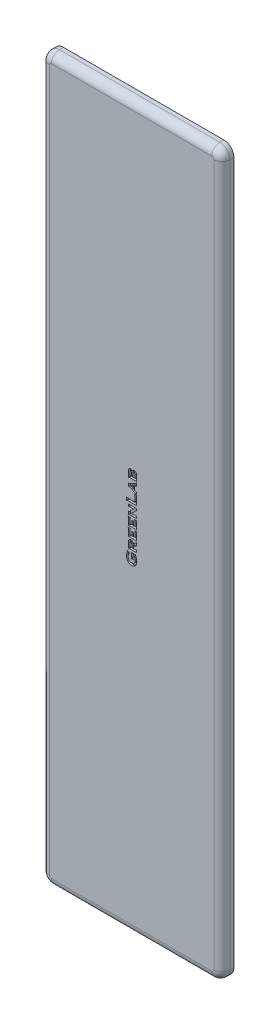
from build123d import *

# Parameters (mm, degrees)
BOSS_EXTRUDE1_DEPTH = 3
FILLET1_R           = 2.5
FILLET2_R           = 2
CUT_EXTRUDE1_DEPTH  = 0.5


with BuildPart() as part:
    # Sketch1 → Boss-Extrude1 (new body)
    with BuildSketch(Plane.XY.offset(3)):
        Polygon((-22.500000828, -67.499998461), (22.499998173, -67.499998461), (22.499998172, 112.500001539), (-22.500000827, 112.500001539), align=None)
    extrude(amount=-BOSS_EXTRUDE1_DEPTH)

    # Fillet1
    fillet1_edges = [part.edges().sort_by_distance(p)[0] for p in [
        (-22.500000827, 112.500001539, 1.5),
        (22.499998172, 112.500001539, 1.5),
        (22.499998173, -67.499998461, 1.5),
        (-22.500000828, -67.499998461, 1.5),
    ]]
    fillet(fillet1_edges, radius=FILLET1_R)

    # Fillet2
    fillet2_edges = [part.edges().sort_by_distance(p)[0] for p in [
        (-1.328e-06, -67.499998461, 3),
        (-22.500000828, 22.500001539, 3),
        (22.499998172, 22.500001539, 3),
        (-1.328e-06, 112.500001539, 3),
        (-21.76776778, 111.767768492, 3),
        (21.767765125, 111.767768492, 3),
        (-21.76776778, -66.767765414, 3),
        (21.767765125, -66.767765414, 3),
    ]]
    fillet(fillet2_edges, radius=FILLET2_R)

    # Sketch2 → Cut-Extrude1 (cut)
    # profile 1 of 8: a face of its own
    with BuildSketch(Plane.XY.offset(3)):
        with BuildLine():
            add(Edge.make_bspline(
                [(0.149737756, 32.573786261), (0.160987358, 32.59764489), (0.182190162, 32.64261269), (0.216982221, 32.703529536), (0.251274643, 32.754864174), (0.276750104, 32.783444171), (0.288626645, 32.796768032)],
                knots=[0, 0, 0, 0, 1.199284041, 2.260363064, 3.188989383, 4, 4, 4, 4], degree=3))
            add(Edge.make_bspline(
                [(0.288626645, 32.796768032), (0.29979615, 32.807686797), (0.322146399, 32.829535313), (0.359591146, 32.85773896), (0.40028128, 32.880998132), (0.443105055, 32.90093009), (0.489353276, 32.915333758), (0.538137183, 32.926237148), (0.58991576, 32.932845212), (0.625340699, 32.933628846), (0.643444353, 32.934029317)],
                knots=[0, 0, 0, 0, 0.957204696, 1.915372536, 2.864513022, 3.827290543, 4.805779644, 5.828215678, 6.89012558, 8, 8, 8, 8], degree=3))
            add(Edge.make_bspline(
                [(0.643444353, 32.934029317), (0.667718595, 32.933487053), (0.715052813, 32.93242965), (0.783999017, 32.921764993), (0.848793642, 32.904777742), (0.9090388, 32.879795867), (0.96540742, 32.849149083), (1.016788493, 32.810327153), (1.064588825, 32.765338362), (1.091833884, 32.730423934), (1.105683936, 32.71267515)],
                knots=[0, 0, 0, 0, 1.09149512, 2.128390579, 3.131133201, 4.098244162, 5.056171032, 6.009871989, 6.988316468, 8, 8, 8, 8], degree=3))
            add(Edge.make_bspline(
                [(1.105683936, 32.71267515), (1.117267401, 32.695720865), (1.140816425, 32.661253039), (1.169712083, 32.60441657), (1.194738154, 32.543453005), (1.215470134, 32.477999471), (1.231169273, 32.407741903), (1.241448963, 32.332768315), (1.249055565, 32.253302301), (1.24967814, 32.198733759), (1.249998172, 32.170682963)],
                knots=[0, 0, 0, 0, 0.863603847, 1.755694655, 2.67743618, 3.635676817, 4.642232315, 5.703768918, 6.81962927, 8, 8, 8, 8], degree=3))
            Line((1.249998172, 32.170682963), (1.249998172, 30.746529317))
            Line((1.249998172, 30.746529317), (1.180553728, 30.746529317))
            add(Edge.make_bspline(
                [(1.180553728, 30.746529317), (1.177623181, 30.755433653), (1.172139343, 30.772096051), (1.162203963, 30.795123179), (1.148957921, 30.812951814), (1.134356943, 30.827491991), (1.116807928, 30.837942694), (1.096627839, 30.845532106), (1.073123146, 30.849790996), (1.056511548, 30.850380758), (1.047632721, 30.850695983)],
                knots=[0, 0, 0, 0, 1.214308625, 2.272296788, 3.227641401, 4.072125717, 4.923398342, 5.849609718, 6.850625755, 8, 8, 8, 8], degree=3))
            Line((1.047632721, 30.850695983), (-0.596247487, 30.850695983))
            add(Edge.make_bspline(
                [(-0.596247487, 30.850695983), (-0.604926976, 30.850288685), (-0.621290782, 30.849520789), (-0.644641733, 30.846369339), (-0.66416822, 30.838320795), (-0.681549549, 30.828657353), (-0.695396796, 30.813814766), (-0.708697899, 30.795901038), (-0.719743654, 30.772714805), (-0.725893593, 30.755628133), (-0.729168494, 30.746529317)],
                knots=[0, 0, 0, 0, 1.128659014, 2.127908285, 3.03439063, 3.855433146, 4.685150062, 5.642745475, 6.744739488, 8, 8, 8, 8], degree=3))
            Line((-0.729168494, 30.746529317), (-0.798612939, 30.746529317))
            Line((-0.798612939, 30.746529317), (-0.798612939, 32.144098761))
            add(Edge.make_bspline(
                [(-0.798612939, 32.144098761), (-0.798251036, 32.173773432), (-0.797552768, 32.231028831), (-0.79068897, 32.313759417), (-0.781014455, 32.390569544), (-0.765612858, 32.461011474), (-0.746968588, 32.525634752), (-0.723378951, 32.583770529), (-0.69682557, 32.636855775), (-0.674090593, 32.667741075), (-0.662979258, 32.68283574)],
                knots=[0, 0, 0, 0, 1.259629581, 2.430375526, 3.522812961, 4.543893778, 5.488959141, 6.374407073, 7.205519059, 8, 8, 8, 8], degree=3))
            add(Edge.make_bspline(
                [(-0.662979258, 32.68283574), (-0.650841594, 32.697438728), (-0.626988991, 32.726136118), (-0.585832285, 32.763198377), (-0.54149608, 32.794408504), (-0.493943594, 32.820011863), (-0.44307772, 32.840469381), (-0.388656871, 32.854100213), (-0.331080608, 32.863326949), (-0.291562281, 32.864158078), (-0.271269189, 32.864584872)],
                knots=[0, 0, 0, 0, 1.01613969, 1.996889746, 2.956405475, 3.914354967, 4.883989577, 5.884961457, 6.913904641, 8, 8, 8, 8], degree=3))
            add(Edge.make_bspline(
                [(-0.271269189, 32.864584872), (-0.247871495, 32.86402936), (-0.202878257, 32.862961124), (-0.138993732, 32.850035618), (-0.081312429, 32.830304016), (-0.029702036, 32.800474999), (0.017372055, 32.759996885), (0.064071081, 32.70980497), (0.107836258, 32.645932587), (0.135237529, 32.598752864), (0.149737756, 32.573786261)],
                knots=[0, 0, 0, 0, 1.030716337, 1.982044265, 2.862735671, 3.709827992, 4.593441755, 5.592771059, 6.726140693, 8, 8, 8, 8], degree=3))
        make_face()
        with BuildLine():
            Line((-0.03472405, 31.336807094), (-0.03472405, 32.063803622))
            add(Edge.make_bspline(
                [(-0.03472405, 32.063803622), (-0.035159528, 32.090411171), (-0.035964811, 32.139613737), (-0.04370633, 32.207132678), (-0.056634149, 32.262343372), (-0.075539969, 32.30623832), (-0.102007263, 32.339792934), (-0.136975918, 32.362782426), (-0.179493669, 32.376567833), (-0.21039312, 32.377813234), (-0.226781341, 32.378473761)],
                knots=[0, 0, 0, 0, 1.512131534, 2.796227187, 3.855933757, 4.725485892, 5.492963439, 6.248574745, 7.071092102, 8, 8, 8, 8], degree=3))
            add(Edge.make_bspline(
                [(-0.226781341, 32.378473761), (-0.242979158, 32.377782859), (-0.273278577, 32.376490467), (-0.31534993, 32.363206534), (-0.349724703, 32.340325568), (-0.376544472, 32.307291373), (-0.395387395, 32.26346797), (-0.407525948, 32.207956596), (-0.415483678, 32.140166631), (-0.416252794, 32.090596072), (-0.416668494, 32.063803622)],
                knots=[0, 0, 0, 0, 0.921305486, 1.723381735, 2.481162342, 3.2428606, 4.114909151, 5.17520465, 6.473222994, 8, 8, 8, 8], degree=3))
            Line((-0.416668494, 32.063803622), (-0.416668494, 31.336807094))
            Line((-0.416668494, 31.336807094), (-0.03472405, 31.336807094))
        make_face(mode=Mode.SUBTRACT)
        with BuildLine():
            Line((0.868053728, 31.336807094), (0.868053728, 32.085505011))
            add(Edge.make_bspline(
                [(0.868053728, 32.085505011), (0.867565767, 32.113963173), (0.866652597, 32.167219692), (0.853833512, 32.241380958), (0.834710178, 32.30502837), (0.805586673, 32.357174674), (0.76845028, 32.398833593), (0.721741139, 32.427278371), (0.667380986, 32.445660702), (0.628235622, 32.447139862), (0.607637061, 32.447918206)],
                knots=[0, 0, 0, 0, 1.344028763, 2.515211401, 3.548364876, 4.471249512, 5.318650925, 6.156286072, 7.02982502, 8, 8, 8, 8], degree=3))
            add(Edge.make_bspline(
                [(0.607637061, 32.447918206), (0.587240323, 32.447082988), (0.548143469, 32.445482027), (0.493705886, 32.427599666), (0.44736724, 32.39843613), (0.409494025, 32.357570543), (0.381460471, 32.304701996), (0.360996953, 32.241603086), (0.349582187, 32.167106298), (0.348043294, 32.113936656), (0.347220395, 32.085505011)],
                knots=[0, 0, 0, 0, 0.962178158, 1.844321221, 2.675172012, 3.52884247, 4.448055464, 5.484422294, 6.65483368, 8, 8, 8, 8], degree=3))
            Line((0.347220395, 32.085505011), (0.347220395, 31.336807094))
            Line((0.347220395, 31.336807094), (0.868053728, 31.336807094))
        make_face(mode=Mode.SUBTRACT)
    # profile 2 of 8: a face of its own
    with BuildSketch(Plane.XY.offset(3)):
        with BuildLine():
            Line((0.729164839, 29.639758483), (0.729164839, 28.689780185))
            Line((0.729164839, 28.689780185), (0.947806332, 28.576390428))
            add(Edge.make_bspline(
                [(0.947806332, 28.576390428), (0.960192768, 28.570549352), (0.983197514, 28.559700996), (1.016500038, 28.547998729), (1.045198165, 28.539239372), (1.063317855, 28.538296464), (1.071504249, 28.537870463)],
                knots=[0, 0, 0, 0, 1.258188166, 2.336773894, 3.248561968, 4, 4, 4, 4], degree=3))
            add(Edge.make_bspline(
                [(1.071504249, 28.537870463), (1.078406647, 28.538352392), (1.091711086, 28.539281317), (1.110837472, 28.54462105), (1.127713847, 28.554902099), (1.14210413, 28.569396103), (1.155730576, 28.586872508), (1.165503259, 28.609204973), (1.174322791, 28.634771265), (1.178400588, 28.653373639), (1.180553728, 28.663195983)],
                knots=[0, 0, 0, 0, 0.910861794, 1.755694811, 2.589696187, 3.483236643, 4.43677035, 5.49240796, 6.675952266, 8, 8, 8, 8], degree=3))
            Line((1.180553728, 28.663195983), (1.249998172, 28.663195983))
            Line((1.249998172, 28.663195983), (1.249998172, 27.934029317))
            Line((1.249998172, 27.934029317), (1.180553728, 27.934029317))
            add(Edge.make_bspline(
                [(1.180553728, 27.934029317), (1.178632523, 27.944935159), (1.174963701, 27.965761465), (1.165953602, 27.994266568), (1.154370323, 28.0184747), (1.139570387, 28.039331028), (1.118917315, 28.057801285), (1.092651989, 28.077588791), (1.05821652, 28.097628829), (1.032671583, 28.111176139), (1.018878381, 28.118491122)],
                knots=[0, 0, 0, 0, 1.025916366, 1.959137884, 2.761484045, 3.50604026, 4.312579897, 5.318573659, 6.552141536, 8, 8, 8, 8], degree=3))
            Line((1.018878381, 28.118491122), (-0.467124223, 28.872614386))
            add(Edge.make_bspline(
                [(-0.467124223, 28.872614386), (-0.480594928, 28.878971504), (-0.506224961, 28.891066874), (-0.544331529, 28.905133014), (-0.580196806, 28.912938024), (-0.603270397, 28.914293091), (-0.614151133, 28.914932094)],
                knots=[0, 0, 0, 0, 1.158371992, 2.203976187, 3.153055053, 4, 4, 4, 4], degree=3))
            add(Edge.make_bspline(
                [(-0.614151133, 28.914932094), (-0.625993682, 28.913640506), (-0.65000118, 28.911022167), (-0.682844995, 28.88967918), (-0.709429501, 28.8553521), (-0.722200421, 28.827207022), (-0.729168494, 28.811850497)],
                knots=[0, 0, 0, 0, 0.861054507, 1.745550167, 2.769926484, 4, 4, 4, 4], degree=3))
            Line((-0.729168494, 28.811850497), (-0.798612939, 28.811850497))
            Line((-0.798612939, 28.811850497), (-0.798612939, 29.609376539))
            Line((-0.798612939, 29.609376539), (-0.729168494, 29.609376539))
            add(Edge.make_bspline(
                [(-0.729168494, 29.609376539), (-0.722548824, 29.594248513), (-0.710249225, 29.566140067), (-0.681155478, 29.533350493), (-0.646163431, 29.512025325), (-0.620221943, 29.509661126), (-0.607098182, 29.508465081)],
                knots=[0, 0, 0, 0, 1.167592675, 2.169431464, 3.073918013, 4, 4, 4, 4], degree=3))
            add(Edge.make_bspline(
                [(-0.607098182, 29.508465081), (-0.596555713, 29.509011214), (-0.57406646, 29.510176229), (-0.539223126, 29.51986982), (-0.500940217, 29.533849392), (-0.475308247, 29.547036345), (-0.461698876, 29.554037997)],
                knots=[0, 0, 0, 0, 0.821709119, 1.75287438, 2.806881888, 4, 4, 4, 4], degree=3))
            Line((-0.461698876, 29.554037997), (0.979273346, 30.326607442))
            add(Edge.make_bspline(
                [(0.979273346, 30.326607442), (0.997230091, 30.336635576), (1.029997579, 30.354934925), (1.073699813, 30.381085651), (1.106647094, 30.404548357), (1.131473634, 30.425292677), (1.149226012, 30.447862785), (1.162532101, 30.473716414), (1.173643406, 30.504134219), (1.178152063, 30.526357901), (1.180553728, 30.538195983)],
                knots=[0, 0, 0, 0, 1.612697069, 2.942851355, 3.989484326, 4.783110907, 5.469570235, 6.224377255, 7.054163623, 8, 8, 8, 8], degree=3))
            Line((1.180553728, 30.538195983), (1.249998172, 30.538195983))
            Line((1.249998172, 30.538195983), (1.249998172, 29.687501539))
            Line((1.249998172, 29.687501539), (1.180553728, 29.687501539))
            add(Edge.make_bspline(
                [(1.180553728, 29.687501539), (1.178787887, 29.696779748), (1.175448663, 29.714324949), (1.167293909, 29.738426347), (1.157093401, 29.758904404), (1.14430489, 29.775549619), (1.129500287, 29.789148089), (1.11185538, 29.798222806), (1.092301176, 29.804005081), (1.078600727, 29.804455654), (1.071504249, 29.804689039)],
                knots=[0, 0, 0, 0, 1.280586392, 2.42160363, 3.442514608, 4.370371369, 5.257057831, 6.146457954, 7.039913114, 8, 8, 8, 8], degree=3))
            add(Edge.make_bspline(
                [(1.071504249, 29.804689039), (1.061684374, 29.804131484), (1.040620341, 29.802935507), (1.007690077, 29.79324006), (0.971552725, 29.778679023), (0.947142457, 29.765524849), (0.934242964, 29.758573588)],
                knots=[0, 0, 0, 0, 0.804870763, 1.726480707, 2.798569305, 4, 4, 4, 4], degree=3))
            Line((0.934242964, 29.758573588), (0.729164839, 29.639758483))
        make_face()
        Polygon((0.451387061, 29.494359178), (-0.203994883, 29.155817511), (0.451387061, 28.829211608), align=None, mode=Mode.SUBTRACT)
    # profile 3 of 8: a face of its own
    with BuildSketch(Plane.XY.offset(3)):
        with BuildLine():
            Line((0.833331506, 26.197918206), (0.833331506, 27.699111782))
            add(Edge.make_bspline(
                [(0.833331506, 27.699111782), (0.832915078, 27.707787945), (0.83212997, 27.72414548), (0.829114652, 27.747369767), (0.820825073, 27.766623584), (0.811289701, 27.783854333), (0.796592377, 27.797734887), (0.778457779, 27.810438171), (0.755322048, 27.820965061), (0.738261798, 27.826768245), (0.729164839, 27.82986265)],
                knots=[0, 0, 0, 0, 1.136312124, 2.142337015, 3.032986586, 3.859596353, 4.69493934, 5.645323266, 6.744426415, 8, 8, 8, 8], degree=3))
            Line((0.729164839, 27.82986265), (0.729164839, 27.899307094))
            Line((0.729164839, 27.899307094), (1.354164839, 27.899307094))
            Line((1.354164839, 27.899307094), (1.354164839, 27.82986265))
            add(Edge.make_bspline(
                [(1.354164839, 27.82986265), (1.345043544, 27.826812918), (1.328092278, 27.821145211), (1.305254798, 27.81010786), (1.286774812, 27.797929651), (1.272104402, 27.783815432), (1.262339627, 27.766754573), (1.255011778, 27.747005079), (1.25098878, 27.723864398), (1.250338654, 27.707263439), (1.249998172, 27.698569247)],
                knots=[0, 0, 0, 0, 1.252901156, 2.328426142, 3.296223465, 4.129788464, 4.954638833, 5.834908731, 6.866106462, 8, 8, 8, 8], degree=3))
            Line((1.249998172, 27.698569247), (1.249998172, 25.538195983))
            Line((1.249998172, 25.538195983), (1.180553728, 25.538195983))
            add(Edge.make_bspline(
                [(1.180553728, 25.538195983), (1.177463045, 25.547296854), (1.171666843, 25.564364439), (1.161094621, 25.587452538), (1.148457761, 25.605841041), (1.134010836, 25.620139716), (1.116674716, 25.630023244), (1.097100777, 25.638024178), (1.073584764, 25.641218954), (1.05703695, 25.64196378), (1.048175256, 25.64236265)],
                knots=[0, 0, 0, 0, 1.245850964, 2.336443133, 3.279467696, 4.125082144, 4.945291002, 5.850852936, 6.849087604, 8, 8, 8, 8], degree=3))
            Line((1.048175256, 25.64236265), (-1.048178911, 25.64236265))
            add(Edge.make_bspline(
                [(-1.048178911, 25.64236265), (-1.057042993, 25.641971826), (-1.073595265, 25.641242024), (-1.097250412, 25.637925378), (-1.117062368, 25.630126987), (-1.134538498, 25.62029367), (-1.148432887, 25.605631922), (-1.16113183, 25.587486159), (-1.171660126, 25.564354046), (-1.177463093, 25.54729324), (-1.180557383, 25.538195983)],
                knots=[0, 0, 0, 0, 1.150172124, 2.147764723, 3.074619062, 3.894300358, 4.722641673, 5.665059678, 6.754950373, 8, 8, 8, 8], degree=3))
            Line((-1.180557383, 25.538195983), (-1.250001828, 25.538195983))
            Line((-1.250001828, 25.538195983), (-1.250001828, 26.302084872))
            Line((-1.250001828, 26.302084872), (-1.180557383, 26.302084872))
            add(Edge.make_bspline(
                [(-1.180557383, 26.302084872), (-1.177673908, 26.292974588), (-1.172323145, 26.276068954), (-1.161933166, 26.253079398), (-1.149706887, 26.234506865), (-1.134995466, 26.220027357), (-1.117300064, 26.210118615), (-1.096902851, 26.203134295), (-1.073309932, 26.198832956), (-1.056517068, 26.198234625), (-1.047636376, 26.197918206)],
                knots=[0, 0, 0, 0, 1.231701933, 2.285625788, 3.242999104, 4.084239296, 4.920290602, 5.83495028, 6.855041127, 8, 8, 8, 8], degree=3))
            Line((-1.047636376, 26.197918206), (0.833331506, 26.197918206))
        make_face()
    # profile 4 of 8: a face of its own
    with BuildSketch(Plane.XY.offset(3)):
        with BuildLine():
            Line((-0.093860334, 23.281251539), (1.046005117, 23.281251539))
            add(Edge.make_bspline(
                [(1.046005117, 23.281251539), (1.054891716, 23.281546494), (1.071517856, 23.282098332), (1.094865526, 23.286595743), (1.115308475, 23.293321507), (1.132881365, 23.304127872), (1.147816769, 23.318599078), (1.16031751, 23.337280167), (1.171847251, 23.35959684), (1.177533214, 23.37646007), (1.180553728, 23.385418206)],
                knots=[0, 0, 0, 0, 1.143670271, 2.139718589, 3.053348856, 3.900396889, 4.773630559, 5.710721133, 6.783882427, 8, 8, 8, 8], degree=3))
            Line((1.180553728, 23.385418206), (1.249998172, 23.385418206))
            Line((1.249998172, 23.385418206), (1.249998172, 22.725695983))
            Line((1.249998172, 22.725695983), (1.180553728, 22.725695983))
            add(Edge.make_bspline(
                [(1.180553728, 22.725695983), (1.177623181, 22.734600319), (1.172139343, 22.751262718), (1.162203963, 22.774289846), (1.148957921, 22.792118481), (1.134356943, 22.806658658), (1.116807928, 22.81710936), (1.096627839, 22.824698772), (1.073123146, 22.828957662), (1.056511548, 22.829547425), (1.047632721, 22.82986265)],
                knots=[0, 0, 0, 0, 1.214308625, 2.272296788, 3.227641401, 4.072125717, 4.923398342, 5.849609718, 6.850625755, 8, 8, 8, 8], degree=3))
            Line((1.047632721, 22.82986265), (-0.596247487, 22.82986265))
            add(Edge.make_bspline(
                [(-0.596247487, 22.82986265), (-0.604926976, 22.829455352), (-0.621290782, 22.828687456), (-0.644641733, 22.825536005), (-0.66416822, 22.817487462), (-0.681549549, 22.80782402), (-0.695396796, 22.792981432), (-0.708697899, 22.775067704), (-0.719743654, 22.751881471), (-0.725893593, 22.734794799), (-0.729168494, 22.725695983)],
                knots=[0, 0, 0, 0, 1.128659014, 2.127908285, 3.03439063, 3.855433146, 4.685150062, 5.642745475, 6.744739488, 8, 8, 8, 8], degree=3))
            Line((-0.729168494, 22.725695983), (-0.798612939, 22.725695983))
            Line((-0.798612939, 22.725695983), (-0.798612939, 23.496637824))
            Line((-0.798612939, 23.496637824), (-0.729168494, 23.496637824))
            add(Edge.make_bspline(
                [(-0.729168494, 23.496637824), (-0.725711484, 23.484846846), (-0.719547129, 23.463821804), (-0.704197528, 23.437701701), (-0.683667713, 23.420120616), (-0.667241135, 23.418314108), (-0.659181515, 23.417427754)],
                knots=[0, 0, 0, 0, 1.287745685, 2.296239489, 3.164058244, 4, 4, 4, 4], degree=3))
            add(Edge.make_bspline(
                [(-0.659181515, 23.417427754), (-0.651666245, 23.418316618), (-0.635253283, 23.42025785), (-0.610678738, 23.432298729), (-0.584454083, 23.450469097), (-0.567815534, 23.466345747), (-0.558812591, 23.474936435)],
                knots=[0, 0, 0, 0, 0.763994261, 1.668524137, 2.738463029, 4, 4, 4, 4], degree=3))
            Line((-0.558812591, 23.474936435), (0.511065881, 24.531251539))
            Line((0.511065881, 24.531251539), (-0.596247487, 24.531251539))
            add(Edge.make_bspline(
                [(-0.596247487, 24.531251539), (-0.604924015, 24.530828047), (-0.621460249, 24.53002093), (-0.645027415, 24.527029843), (-0.664831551, 24.51874693), (-0.682558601, 24.509217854), (-0.697059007, 24.494706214), (-0.709713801, 24.476349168), (-0.720280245, 24.453250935), (-0.726077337, 24.436184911), (-0.729168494, 24.427084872)],
                knots=[0, 0, 0, 0, 1.124712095, 2.143541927, 3.046854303, 3.885165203, 4.728679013, 5.669360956, 6.757243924, 8, 8, 8, 8], degree=3))
            Line((-0.729168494, 24.427084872), (-0.798612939, 24.427084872))
            Line((-0.798612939, 24.427084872), (-0.798612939, 25.086807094))
            Line((-0.798612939, 25.086807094), (-0.729168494, 25.086807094))
            add(Edge.make_bspline(
                [(-0.729168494, 25.086807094), (-0.726121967, 25.077682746), (-0.720460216, 25.060725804), (-0.709384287, 25.037925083), (-0.697257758, 25.019219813), (-0.682519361, 25.004740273), (-0.664961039, 24.99497218), (-0.644830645, 24.987745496), (-0.621548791, 24.983612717), (-0.604943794, 24.982974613), (-0.596247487, 24.982640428)],
                knots=[0, 0, 0, 0, 1.243685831, 2.311300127, 3.271979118, 4.116123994, 4.955062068, 5.850833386, 6.874446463, 8, 8, 8, 8], degree=3))
            Line((-0.596247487, 24.982640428), (1.046005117, 24.982640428))
            add(Edge.make_bspline(
                [(1.046005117, 24.982640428), (1.054703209, 24.982971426), (1.071311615, 24.983603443), (1.094570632, 24.987776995), (1.114626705, 24.994820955), (1.131817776, 25.004914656), (1.14649736, 25.019321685), (1.159079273, 25.038008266), (1.171465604, 25.060520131), (1.177387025, 25.077647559), (1.180553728, 25.086807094)],
                knots=[0, 0, 0, 0, 1.122381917, 2.143110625, 3.036357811, 3.852834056, 4.694600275, 5.665840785, 6.751720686, 8, 8, 8, 8], degree=3))
            Line((1.180553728, 25.086807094), (1.249998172, 25.086807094))
            Line((1.249998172, 25.086807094), (1.249998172, 24.368491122))
            Line((1.249998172, 24.368491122), (1.180553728, 24.368491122))
            add(Edge.make_bspline(
                [(1.180553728, 24.368491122), (1.177586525, 24.380041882), (1.172236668, 24.400867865), (1.158683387, 24.42721652), (1.138614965, 24.444469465), (1.122781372, 24.44626547), (1.114907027, 24.447158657)],
                knots=[0, 0, 0, 0, 1.28387963, 2.314830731, 3.161933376, 4, 4, 4, 4], degree=3))
            add(Edge.make_bspline(
                [(1.114907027, 24.447158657), (1.106199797, 24.44594213), (1.087081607, 24.443271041), (1.06490045, 24.427812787), (1.044094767, 24.409164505), (1.020955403, 24.388299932), (0.99141002, 24.360350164), (0.969997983, 24.33906922), (0.958114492, 24.327258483)],
                knots=[0, 0, 0, 0, 0.778870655, 1.71014178, 2.353616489, 3.294570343, 4.498510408, 6, 6, 6, 6], degree=3))
            Line((0.958114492, 24.327258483), (-0.093860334, 23.281251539))
        make_face()
    # profile 5 of 8: a face of its own
    with BuildSketch(Plane.XY.offset(3)):
        with BuildLine():
            Line((0.416664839, 20.920140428), (0.868053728, 20.920140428))
            Line((0.868053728, 20.920140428), (0.868053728, 22.178278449))
            add(Edge.make_bspline(
                [(0.868053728, 22.178278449), (0.867665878, 22.186963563), (0.866942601, 22.203159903), (0.863598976, 22.226263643), (0.855882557, 22.245613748), (0.845639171, 22.262548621), (0.831557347, 22.27694832), (0.813135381, 22.289565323), (0.790058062, 22.300143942), (0.772988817, 22.305939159), (0.763887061, 22.309029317)],
                knots=[0, 0, 0, 0, 1.136968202, 2.120262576, 3.033418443, 3.84032541, 4.69303108, 5.643963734, 6.743701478, 8, 8, 8, 8], degree=3))
            Line((0.763887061, 22.309029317), (0.763887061, 22.378473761))
            Line((0.763887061, 22.378473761), (1.354164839, 22.378473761))
            Line((1.354164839, 22.378473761), (1.354164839, 22.309029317))
            add(Edge.make_bspline(
                [(1.354164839, 22.309029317), (1.345208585, 22.306396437), (1.328326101, 22.301433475), (1.305884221, 22.290487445), (1.287542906, 22.277888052), (1.272892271, 22.263579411), (1.261942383, 22.2463861), (1.255365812, 22.226042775), (1.250873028, 22.202887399), (1.250300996, 22.186441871), (1.249998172, 22.177735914)],
                knots=[0, 0, 0, 0, 1.21379651, 2.287998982, 3.235193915, 4.101035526, 4.937230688, 5.860712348, 6.867500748, 8, 8, 8, 8], degree=3))
            Line((1.249998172, 22.177735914), (1.249998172, 20.32986265))
            Line((1.249998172, 20.32986265), (1.180553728, 20.32986265))
            add(Edge.make_bspline(
                [(1.180553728, 20.32986265), (1.177623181, 20.338766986), (1.172139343, 20.355429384), (1.162203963, 20.378456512), (1.148957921, 20.396285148), (1.134356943, 20.410825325), (1.116807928, 20.421276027), (1.096627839, 20.428865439), (1.073123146, 20.433124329), (1.056511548, 20.433714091), (1.047632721, 20.434029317)],
                knots=[0, 0, 0, 0, 1.214308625, 2.272296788, 3.227641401, 4.072125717, 4.923398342, 5.849609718, 6.850625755, 8, 8, 8, 8], degree=3))
            Line((1.047632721, 20.434029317), (-0.596247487, 20.434029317))
            add(Edge.make_bspline(
                [(-0.596247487, 20.434029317), (-0.604926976, 20.433622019), (-0.621290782, 20.432854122), (-0.644641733, 20.429702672), (-0.66416822, 20.421654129), (-0.681549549, 20.411990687), (-0.695396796, 20.397148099), (-0.708697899, 20.379234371), (-0.719743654, 20.356048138), (-0.725893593, 20.338961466), (-0.729168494, 20.32986265)],
                knots=[0, 0, 0, 0, 1.128659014, 2.127908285, 3.03439063, 3.855433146, 4.685150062, 5.642745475, 6.744739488, 8, 8, 8, 8], degree=3))
            Line((-0.729168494, 20.32986265), (-0.798612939, 20.32986265))
            Line((-0.798612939, 20.32986265), (-0.798612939, 22.107748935))
            add(Edge.make_bspline(
                [(-0.798612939, 22.107748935), (-0.799011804, 22.116610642), (-0.799756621, 22.13315848), (-0.802951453, 22.156674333), (-0.810952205, 22.176248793), (-0.820836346, 22.193583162), (-0.835132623, 22.208036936), (-0.853531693, 22.220643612), (-0.876516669, 22.231329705), (-0.893663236, 22.236719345), (-0.902779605, 22.239584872)],
                knots=[0, 0, 0, 0, 1.152027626, 2.151229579, 3.057668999, 3.878672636, 4.725106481, 5.669044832, 6.76069378, 8, 8, 8, 8], degree=3))
            Line((-0.902779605, 22.239584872), (-0.902779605, 22.309029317))
            Line((-0.902779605, 22.309029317), (-0.312501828, 22.309029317))
            Line((-0.312501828, 22.309029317), (-0.312501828, 22.239584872))
            add(Edge.make_bspline(
                [(-0.312501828, 22.239584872), (-0.321626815, 22.236731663), (-0.338789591, 22.231365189), (-0.361803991, 22.220463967), (-0.380644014, 22.208220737), (-0.394947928, 22.193554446), (-0.404861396, 22.17649805), (-0.412336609, 22.156775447), (-0.415479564, 22.133522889), (-0.416259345, 22.116974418), (-0.416668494, 22.108291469)],
                knots=[0, 0, 0, 0, 1.241043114, 2.334222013, 3.298856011, 4.146476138, 4.968630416, 5.84602308, 6.869812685, 8, 8, 8, 8], degree=3))
            Line((-0.416668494, 22.108291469), (-0.416668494, 20.920140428))
            Line((-0.416668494, 20.920140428), (0.034720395, 20.920140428))
            Line((0.034720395, 20.920140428), (0.034720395, 21.657445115))
            add(Edge.make_bspline(
                [(0.034720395, 21.657445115), (0.034315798, 21.665945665), (0.033553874, 21.681953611), (0.030376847, 21.704752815), (0.022411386, 21.723822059), (0.012316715, 21.740629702), (-0.001767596, 21.755052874), (-0.020319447, 21.767581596), (-0.043214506, 21.778829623), (-0.060331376, 21.784941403), (-0.069446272, 21.788195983)],
                knots=[0, 0, 0, 0, 1.117146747, 2.103772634, 2.997955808, 3.807596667, 4.6631914, 5.617345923, 6.731213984, 8, 8, 8, 8], degree=3))
            Line((-0.069446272, 21.788195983), (-0.069446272, 21.857640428))
            Line((-0.069446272, 21.857640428), (0.520831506, 21.857640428))
            Line((0.520831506, 21.857640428), (0.520831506, 21.788195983))
            add(Edge.make_bspline(
                [(0.520831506, 21.788195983), (0.511881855, 21.785350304), (0.49506055, 21.78000171), (0.472485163, 21.768956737), (0.453935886, 21.756838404), (0.439393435, 21.742531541), (0.42889266, 21.725810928), (0.421725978, 21.705851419), (0.41764132, 21.682749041), (0.417000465, 21.666142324), (0.416664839, 21.657445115)],
                knots=[0, 0, 0, 0, 1.225527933, 2.303439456, 3.273384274, 4.108798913, 4.947881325, 5.830104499, 6.863590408, 8, 8, 8, 8], degree=3))
            Line((0.416664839, 21.657445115), (0.416664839, 20.920140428))
        make_face()
    # profile 6 of 8: a face of its own
    with BuildSketch(Plane.XY.offset(3)):
        with BuildLine():
            Line((0.416664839, 18.524307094), (0.868053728, 18.524307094))
            Line((0.868053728, 18.524307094), (0.868053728, 19.782445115))
            add(Edge.make_bspline(
                [(0.868053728, 19.782445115), (0.867665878, 19.79113023), (0.866942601, 19.80732657), (0.863598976, 19.83043031), (0.855882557, 19.849780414), (0.845639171, 19.866715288), (0.831557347, 19.881114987), (0.813135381, 19.89373199), (0.790058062, 19.904310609), (0.772988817, 19.910105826), (0.763887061, 19.913195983)],
                knots=[0, 0, 0, 0, 1.136968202, 2.120262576, 3.033418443, 3.84032541, 4.69303108, 5.643963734, 6.743701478, 8, 8, 8, 8], degree=3))
            Line((0.763887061, 19.913195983), (0.763887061, 19.982640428))
            Line((0.763887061, 19.982640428), (1.354164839, 19.982640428))
            Line((1.354164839, 19.982640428), (1.354164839, 19.913195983))
            add(Edge.make_bspline(
                [(1.354164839, 19.913195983), (1.345208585, 19.910563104), (1.328326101, 19.905600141), (1.305884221, 19.894654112), (1.287542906, 19.882054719), (1.272892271, 19.867746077), (1.261942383, 19.850552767), (1.255365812, 19.830209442), (1.250873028, 19.807054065), (1.250300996, 19.790608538), (1.249998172, 19.781902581)],
                knots=[0, 0, 0, 0, 1.21379651, 2.287998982, 3.235193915, 4.101035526, 4.937230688, 5.860712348, 6.867500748, 8, 8, 8, 8], degree=3))
            Line((1.249998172, 19.781902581), (1.249998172, 17.934029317))
            Line((1.249998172, 17.934029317), (1.180553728, 17.934029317))
            add(Edge.make_bspline(
                [(1.180553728, 17.934029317), (1.177623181, 17.942933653), (1.172139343, 17.959596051), (1.162203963, 17.982623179), (1.148957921, 18.000451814), (1.134356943, 18.014991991), (1.116807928, 18.025442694), (1.096627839, 18.033032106), (1.073123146, 18.037290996), (1.056511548, 18.037880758), (1.047632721, 18.038195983)],
                knots=[0, 0, 0, 0, 1.214308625, 2.272296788, 3.227641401, 4.072125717, 4.923398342, 5.849609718, 6.850625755, 8, 8, 8, 8], degree=3))
            Line((1.047632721, 18.038195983), (-0.596247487, 18.038195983))
            add(Edge.make_bspline(
                [(-0.596247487, 18.038195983), (-0.604926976, 18.037788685), (-0.621290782, 18.037020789), (-0.644641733, 18.033869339), (-0.66416822, 18.025820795), (-0.681549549, 18.016157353), (-0.695396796, 18.001314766), (-0.708697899, 17.983401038), (-0.719743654, 17.960214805), (-0.725893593, 17.943128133), (-0.729168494, 17.934029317)],
                knots=[0, 0, 0, 0, 1.128659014, 2.127908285, 3.03439063, 3.855433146, 4.685150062, 5.642745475, 6.744739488, 8, 8, 8, 8], degree=3))
            Line((-0.729168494, 17.934029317), (-0.798612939, 17.934029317))
            Line((-0.798612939, 17.934029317), (-0.798612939, 19.711915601))
            add(Edge.make_bspline(
                [(-0.798612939, 19.711915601), (-0.799011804, 19.720777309), (-0.799756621, 19.737325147), (-0.802951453, 19.760841), (-0.810952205, 19.780415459), (-0.820836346, 19.797749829), (-0.835132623, 19.812203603), (-0.853531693, 19.824810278), (-0.876516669, 19.835496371), (-0.893663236, 19.840886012), (-0.902779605, 19.843751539)],
                knots=[0, 0, 0, 0, 1.152027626, 2.151229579, 3.057668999, 3.878672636, 4.725106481, 5.669044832, 6.76069378, 8, 8, 8, 8], degree=3))
            Line((-0.902779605, 19.843751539), (-0.902779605, 19.913195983))
            Line((-0.902779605, 19.913195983), (-0.312501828, 19.913195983))
            Line((-0.312501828, 19.913195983), (-0.312501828, 19.843751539))
            add(Edge.make_bspline(
                [(-0.312501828, 19.843751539), (-0.321626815, 19.840898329), (-0.338789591, 19.835531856), (-0.361803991, 19.824630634), (-0.380644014, 19.812387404), (-0.394947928, 19.797721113), (-0.404861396, 19.780664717), (-0.412336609, 19.760942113), (-0.415479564, 19.737689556), (-0.416259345, 19.721141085), (-0.416668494, 19.712458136)],
                knots=[0, 0, 0, 0, 1.241043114, 2.334222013, 3.298856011, 4.146476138, 4.968630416, 5.84602308, 6.869812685, 8, 8, 8, 8], degree=3))
            Line((-0.416668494, 19.712458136), (-0.416668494, 18.524307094))
            Line((-0.416668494, 18.524307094), (0.034720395, 18.524307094))
            Line((0.034720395, 18.524307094), (0.034720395, 19.261611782))
            add(Edge.make_bspline(
                [(0.034720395, 19.261611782), (0.034315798, 19.270112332), (0.033553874, 19.286120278), (0.030376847, 19.308919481), (0.022411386, 19.327988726), (0.012316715, 19.344796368), (-0.001767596, 19.359219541), (-0.020319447, 19.371748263), (-0.043214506, 19.38299629), (-0.060331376, 19.389108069), (-0.069446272, 19.39236265)],
                knots=[0, 0, 0, 0, 1.117146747, 2.103772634, 2.997955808, 3.807596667, 4.6631914, 5.617345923, 6.731213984, 8, 8, 8, 8], degree=3))
            Line((-0.069446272, 19.39236265), (-0.069446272, 19.461807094))
            Line((-0.069446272, 19.461807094), (0.520831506, 19.461807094))
            Line((0.520831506, 19.461807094), (0.520831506, 19.39236265))
            add(Edge.make_bspline(
                [(0.520831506, 19.39236265), (0.511881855, 19.38951697), (0.49506055, 19.384168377), (0.472485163, 19.373123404), (0.453935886, 19.361005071), (0.439393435, 19.346698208), (0.42889266, 19.329977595), (0.421725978, 19.310018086), (0.41764132, 19.286915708), (0.417000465, 19.27030899), (0.416664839, 19.261611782)],
                knots=[0, 0, 0, 0, 1.225527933, 2.303439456, 3.273384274, 4.108798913, 4.947881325, 5.830104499, 6.863590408, 8, 8, 8, 8], degree=3))
            Line((0.416664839, 19.261611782), (0.416664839, 18.524307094))
        make_face()
    # profile 7 of 8: a face of its own
    with BuildSketch(Plane.XY.offset(3)):
        with BuildLine():
            Line((0.416664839, 15.95486265), (1.048175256, 15.95486265))
            add(Edge.make_bspline(
                [(1.048175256, 15.95486265), (1.056881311, 15.955157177), (1.073149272, 15.955707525), (1.095965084, 15.960196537), (1.115629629, 15.966875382), (1.132429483, 15.977326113), (1.14702573, 15.991532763), (1.159706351, 16.010097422), (1.171325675, 16.0329081), (1.177328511, 16.049899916), (1.180553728, 16.059029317)],
                knots=[0, 0, 0, 0, 1.133233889, 2.117538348, 3.019422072, 3.823678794, 4.673583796, 5.654214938, 6.739651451, 8, 8, 8, 8], degree=3))
            Line((1.180553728, 16.059029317), (1.249998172, 16.059029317))
            Line((1.249998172, 16.059029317), (1.249998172, 15.364584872))
            Line((1.249998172, 15.364584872), (1.180553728, 15.364584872))
            add(Edge.make_bspline(
                [(1.180553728, 15.364584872), (1.177623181, 15.373489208), (1.172139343, 15.390151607), (1.162203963, 15.413178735), (1.148957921, 15.43100737), (1.134356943, 15.445547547), (1.116807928, 15.455998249), (1.096627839, 15.463587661), (1.073123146, 15.467846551), (1.056511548, 15.468436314), (1.047632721, 15.468751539)],
                knots=[0, 0, 0, 0, 1.214308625, 2.272296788, 3.227641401, 4.072125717, 4.923398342, 5.849609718, 6.850625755, 8, 8, 8, 8], degree=3))
            Line((1.047632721, 15.468751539), (-0.596247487, 15.468751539))
            add(Edge.make_bspline(
                [(-0.596247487, 15.468751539), (-0.604926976, 15.468344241), (-0.621290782, 15.467576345), (-0.644641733, 15.464424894), (-0.66416822, 15.456376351), (-0.681549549, 15.446712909), (-0.695396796, 15.431870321), (-0.708697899, 15.413956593), (-0.719743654, 15.39077036), (-0.725893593, 15.373683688), (-0.729168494, 15.364584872)],
                knots=[0, 0, 0, 0, 1.128659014, 2.127908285, 3.03439063, 3.855433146, 4.685150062, 5.642745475, 6.744739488, 8, 8, 8, 8], degree=3))
            Line((-0.729168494, 15.364584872), (-0.798612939, 15.364584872))
            Line((-0.798612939, 15.364584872), (-0.798612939, 16.694880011))
            add(Edge.make_bspline(
                [(-0.798612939, 16.694880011), (-0.798347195, 16.73557587), (-0.797849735, 16.811756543), (-0.793078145, 16.918356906), (-0.785382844, 17.009476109), (-0.774084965, 17.087324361), (-0.758127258, 17.155906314), (-0.736252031, 17.218598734), (-0.709816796, 17.278085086), (-0.687610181, 17.314668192), (-0.676542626, 17.332900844)],
                knots=[0, 0, 0, 0, 1.481606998, 2.773496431, 3.884065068, 4.809673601, 5.635344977, 6.4432619, 7.224137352, 8, 8, 8, 8], degree=3))
            add(Edge.make_bspline(
                [(-0.676542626, 17.332900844), (-0.664004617, 17.350475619), (-0.639268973, 17.38514806), (-0.594042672, 17.429916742), (-0.543464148, 17.467844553), (-0.487112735, 17.499053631), (-0.424702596, 17.522676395), (-0.357052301, 17.540066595), (-0.28371038, 17.550506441), (-0.232965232, 17.551546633), (-0.206707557, 17.552084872)],
                knots=[0, 0, 0, 0, 0.954938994, 1.883953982, 2.805234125, 3.748304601, 4.727237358, 5.753162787, 6.837391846, 8, 8, 8, 8], degree=3))
            add(Edge.make_bspline(
                [(-0.206707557, 17.552084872), (-0.186616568, 17.551686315), (-0.147409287, 17.550908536), (-0.090221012, 17.544328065), (-0.036561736, 17.533433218), (0.014019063, 17.519094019), (0.060655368, 17.499165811), (0.104675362, 17.476017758), (0.144662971, 17.447610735), (0.181703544, 17.415167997), (0.215343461, 17.377766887), (0.2472853, 17.335798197), (0.275491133, 17.28798303), (0.301927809, 17.235288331), (0.325388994, 17.177278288), (0.347288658, 17.114178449), (0.366136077, 17.04560214), (0.376561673, 16.997847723), (0.381942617, 16.973200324)],
                knots=[0, 0, 0, 0, 1.054974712, 2.05876829, 3.018077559, 3.928757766, 4.81427522, 5.67693176, 6.535972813, 7.383915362, 8.257948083, 9.17356801, 10.149288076, 11.168732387, 12.267602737, 13.433048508, 14.67512408, 16, 16, 16, 16], degree=3))
            Line((0.381942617, 16.973200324), (0.917424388, 17.37033574))
            add(Edge.make_bspline(
                [(0.917424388, 17.37033574), (0.939838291, 17.387302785), (0.981290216, 17.418681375), (1.036053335, 17.464974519), (1.080187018, 17.504860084), (1.113745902, 17.541155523), (1.138891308, 17.576361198), (1.157984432, 17.612484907), (1.172470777, 17.650754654), (1.177844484, 17.67749312), (1.180553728, 17.690973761)],
                knots=[0, 0, 0, 0, 1.582811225, 2.927226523, 4.03709032, 4.931114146, 5.705394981, 6.46623019, 7.226724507, 8, 8, 8, 8], degree=3))
            Line((1.180553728, 17.690973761), (1.249998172, 17.690973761))
            Line((1.249998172, 17.690973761), (1.249998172, 16.76595206))
            Line((1.249998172, 16.76595206), (1.180553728, 16.76595206))
            add(Edge.make_bspline(
                [(1.180553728, 16.76595206), (1.176467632, 16.780683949), (1.169182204, 16.806950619), (1.151359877, 16.839111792), (1.128879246, 16.861717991), (1.110222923, 16.864101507), (1.101343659, 16.865235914)],
                knots=[0, 0, 0, 0, 1.338390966, 2.386324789, 3.231989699, 4, 4, 4, 4], degree=3))
            add(Edge.make_bspline(
                [(1.101343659, 16.865235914), (1.093817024, 16.864358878), (1.076570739, 16.862349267), (1.049721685, 16.848241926), (1.017186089, 16.829290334), (0.995154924, 16.811861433), (0.983071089, 16.802301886)],
                knots=[0, 0, 0, 0, 0.664756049, 1.523200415, 2.641504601, 4, 4, 4, 4], degree=3))
            Line((0.983071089, 16.802301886), (0.416664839, 16.39377324))
            Line((0.416664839, 16.39377324), (0.416664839, 15.95486265))
        make_face()
        with BuildLine():
            Line((0.034720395, 15.95486265), (0.034720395, 16.700305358))
            add(Edge.make_bspline(
                [(0.034720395, 16.700305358), (0.034367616, 16.726728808), (0.033709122, 16.77605065), (0.027380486, 16.844628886), (0.017078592, 16.90265435), (0.004584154, 16.936250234), (-0.001086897, 16.951498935)],
                knots=[0, 0, 0, 0, 1.241709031, 2.317766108, 3.236457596, 4, 4, 4, 4], degree=3))
            add(Edge.make_bspline(
                [(-0.001086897, 16.951498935), (-0.005350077, 16.96050749), (-0.013676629, 16.978102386), (-0.030301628, 17.001555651), (-0.049122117, 17.022188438), (-0.072153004, 17.038030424), (-0.097809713, 17.050466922), (-0.126242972, 17.05976447), (-0.15766637, 17.065271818), (-0.179557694, 17.065733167), (-0.19097405, 17.065973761)],
                knots=[0, 0, 0, 0, 1.008030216, 1.968815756, 2.902121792, 3.822384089, 4.781245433, 5.783764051, 6.844229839, 8, 8, 8, 8], degree=3))
            add(Edge.make_bspline(
                [(-0.19097405, 17.065973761), (-0.21062161, 17.065245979), (-0.247356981, 17.063885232), (-0.297847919, 17.048534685), (-0.338926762, 17.022824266), (-0.364867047, 16.992413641), (-0.37924452, 16.962767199), (-0.390083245, 16.937096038), (-0.397559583, 16.907001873), (-0.404882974, 16.873237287), (-0.410061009, 16.835502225), (-0.413661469, 16.793852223), (-0.416703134, 16.748452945), (-0.416680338, 16.716768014), (-0.416668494, 16.700305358)],
                knots=[0, 0, 0, 0, 1.425165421, 2.66465546, 3.788225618, 4.907941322, 5.513716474, 6.180377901, 6.930065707, 7.763120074, 8.692993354, 9.696653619, 10.803241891, 12, 12, 12, 12], degree=3))
            Line((-0.416668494, 16.700305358), (-0.416668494, 15.95486265))
            Line((-0.416668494, 15.95486265), (0.034720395, 15.95486265))
        make_face(mode=Mode.SUBTRACT)
    # profile 8 of 8: a face of its own
    with BuildSketch(Plane.XY.offset(3)):
        with BuildLine():
            Line((0.347220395, 14.39236265), (0.347220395, 13.763022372))
            add(Edge.make_bspline(
                [(0.347220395, 13.763022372), (0.347540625, 13.753961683), (0.348146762, 13.736811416), (0.352381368, 13.712847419), (0.359298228, 13.692386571), (0.369353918, 13.675079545), (0.383974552, 13.660916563), (0.402616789, 13.648866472), (0.425149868, 13.637042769), (0.442235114, 13.631462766), (0.451387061, 13.628473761)],
                knots=[0, 0, 0, 0, 1.162769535, 2.20091524, 3.111292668, 3.923438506, 4.744164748, 5.697055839, 6.76639631, 8, 8, 8, 8], degree=3))
            Line((0.451387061, 13.628473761), (0.451387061, 13.559029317))
            Line((0.451387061, 13.559029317), (-0.104168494, 13.559029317))
            Line((-0.104168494, 13.559029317), (-0.104168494, 13.628473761))
            add(Edge.make_bspline(
                [(-0.104168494, 13.628473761), (-0.094827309, 13.631451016), (-0.077375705, 13.637013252), (-0.054661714, 13.648881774), (-0.035490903, 13.660133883), (-0.021802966, 13.674692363), (-0.01151042, 13.691221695), (-0.004479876, 13.711168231), (-0.001125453, 13.734698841), (-0.00039097, 13.751439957), (-1.828e-06, 13.760309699)],
                knots=[0, 0, 0, 0, 1.267855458, 2.368662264, 3.318017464, 4.130433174, 4.930580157, 5.827855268, 6.849158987, 8, 8, 8, 8], degree=3))
            Line((-1.828e-06, 13.760309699), (-1.828e-06, 14.947918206))
            Line((-1.828e-06, 14.947918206), (0.069442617, 14.947918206))
            add(Edge.make_bspline(
                [(0.069442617, 14.947918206), (0.072257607, 14.938948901), (0.077548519, 14.922090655), (0.088884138, 14.899933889), (0.099620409, 14.880887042), (0.113436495, 14.866734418), (0.129270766, 14.855657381), (0.148457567, 14.849206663), (0.17031343, 14.844559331), (0.185875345, 14.844033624), (0.194225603, 14.843751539)],
                knots=[0, 0, 0, 0, 1.260451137, 2.369079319, 3.340265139, 4.182477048, 5.004819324, 5.912182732, 6.879712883, 8, 8, 8, 8], degree=3))
            Line((0.194225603, 14.843751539), (0.673826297, 14.843751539))
            add(Edge.make_bspline(
                [(0.673826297, 14.843751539), (0.682155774, 14.844120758), (0.697644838, 14.844807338), (0.71955437, 14.848346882), (0.7381556, 14.855414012), (0.754278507, 14.865532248), (0.767788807, 14.880010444), (0.779435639, 14.89875492), (0.790418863, 14.921615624), (0.795766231, 14.938788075), (0.798609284, 14.947918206)],
                knots=[0, 0, 0, 0, 1.117892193, 2.078774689, 2.961505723, 3.768722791, 4.60913424, 5.591204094, 6.719307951, 8, 8, 8, 8], degree=3))
            Line((0.798609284, 14.947918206), (0.868053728, 14.947918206))
            add(Edge.make_bspline(
                [(0.868053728, 14.947918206), (0.901304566, 14.889335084), (0.966664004, 14.774181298), (1.051146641, 14.597913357), (1.123081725, 14.423167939), (1.181931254, 14.249783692), (1.227920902, 14.077821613), (1.260406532, 13.907210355), (1.280910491, 13.73784406), (1.283455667, 13.625274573), (1.284720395, 13.569337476)],
                knots=[0, 0, 0, 0, 1.109239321, 2.180373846, 3.216973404, 4.220153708, 5.194106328, 6.146335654, 7.078892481, 8, 8, 8, 8], degree=3))
            add(Edge.make_bspline(
                [(1.284720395, 13.569337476), (1.283984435, 13.519932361), (1.282547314, 13.423458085), (1.268487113, 13.282270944), (1.246539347, 13.148076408), (1.215804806, 13.020600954), (1.175550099, 12.90004624), (1.12616369, 12.786603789), (1.068181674, 12.679742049), (1.022225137, 12.614073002), (0.999347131, 12.581381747)],
                knots=[0, 0, 0, 0, 1.132985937, 2.212402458, 3.251065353, 4.250163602, 5.21697858, 6.162602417, 7.085309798, 8, 8, 8, 8], degree=3))
            add(Edge.make_bspline(
                [(0.999347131, 12.581381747), (0.984166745, 12.561877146), (0.954032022, 12.523158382), (0.905926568, 12.468374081), (0.855024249, 12.417839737), (0.802717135, 12.370451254), (0.747399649, 12.327408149), (0.690093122, 12.288028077), (0.63093874, 12.251829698), (0.569178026, 12.220577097), (0.505622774, 12.192023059), (0.439557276, 12.167823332), (0.371387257, 12.147272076), (0.301269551, 12.129527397), (0.228691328, 12.116816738), (0.153889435, 12.10774098), (0.07714947, 12.101321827), (0.025149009, 12.100905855), (-0.001086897, 12.100695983)],
                knots=[0, 0, 0, 0, 1.027594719, 2.039887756, 3.02889878, 4.008719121, 4.97294883, 5.940778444, 6.898978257, 7.854104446, 8.816896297, 9.794723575, 10.777166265, 11.776613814, 12.800294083, 13.838400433, 14.909403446, 16, 16, 16, 16], degree=3))
            add(Edge.make_bspline(
                [(-0.001086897, 12.100695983), (-0.049626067, 12.101837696), (-0.144428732, 12.104067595), (-0.282855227, 12.124689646), (-0.413615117, 12.158279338), (-0.537143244, 12.204811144), (-0.652472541, 12.265876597), (-0.760531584, 12.339327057), (-0.860944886, 12.426806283), (-0.919976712, 12.49404083), (-0.949980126, 12.528213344)],
                knots=[0, 0, 0, 0, 1.080618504, 2.110574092, 3.109061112, 4.08310081, 5.043468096, 6.008781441, 6.987946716, 8, 8, 8, 8], degree=3))
            add(Edge.make_bspline(
                [(-0.949980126, 12.528213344), (-0.977012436, 12.562732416), (-1.031321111, 12.632082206), (-1.098572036, 12.747215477), (-1.156517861, 12.869865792), (-1.203688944, 13.001042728), (-1.239850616, 13.140574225), (-1.265690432, 13.288249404), (-1.281669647, 13.444203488), (-1.283690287, 13.551033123), (-1.28472405, 13.605687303)],
                knots=[0, 0, 0, 0, 0.913103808, 1.834451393, 2.772129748, 3.738097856, 4.735733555, 5.773315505, 6.860825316, 8, 8, 8, 8], degree=3))
            add(Edge.make_bspline(
                [(-1.28472405, 13.605687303), (-1.284114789, 13.640780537), (-1.282913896, 13.709951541), (-1.276050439, 13.812135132), (-1.263399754, 13.911163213), (-1.245836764, 14.008996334), (-1.221900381, 14.108497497), (-1.191811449, 14.213104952), (-1.154969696, 14.324019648), (-1.126399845, 14.399515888), (-1.111655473, 14.438478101)],
                knots=[0, 0, 0, 0, 0.983904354, 1.939338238, 2.869415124, 3.781350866, 4.72455948, 5.737149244, 6.832184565, 8, 8, 8, 8], degree=3))
            add(Edge.make_bspline(
                [(-1.111655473, 14.438478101), (-1.104224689, 14.45757965), (-1.090592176, 14.492623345), (-1.074749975, 14.541238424), (-1.064489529, 14.581118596), (-1.06257283, 14.604997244), (-1.061742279, 14.615344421)],
                knots=[0, 0, 0, 0, 1.33242011, 2.444457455, 3.325947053, 4, 4, 4, 4], degree=3))
            add(Edge.make_bspline(
                [(-1.061742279, 14.615344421), (-1.062381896, 14.622085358), (-1.06374752, 14.636477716), (-1.071787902, 14.658598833), (-1.086115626, 14.6814111), (-1.0977736, 14.696646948), (-1.104059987, 14.70486265)],
                knots=[0, 0, 0, 0, 0.803820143, 1.716210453, 2.768500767, 4, 4, 4, 4], degree=3))
            Line((-1.104059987, 14.70486265), (-1.076390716, 14.774307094))
            Line((-1.076390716, 14.774307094), (-0.477432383, 14.479168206))
            Line((-0.477432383, 14.479168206), (-0.505644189, 14.425999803))
            add(Edge.make_bspline(
                [(-0.505644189, 14.425999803), (-0.515251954, 14.425698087), (-0.532923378, 14.425143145), (-0.557162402, 14.420974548), (-0.577294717, 14.41651739), (-0.594500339, 14.409834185), (-0.60946894, 14.398650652), (-0.625854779, 14.384751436), (-0.642930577, 14.365337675), (-0.654547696, 14.350817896), (-0.660809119, 14.34299199)],
                knots=[0, 0, 0, 0, 1.244331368, 2.288680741, 3.181265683, 3.916936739, 4.658188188, 5.588746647, 6.700376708, 8, 8, 8, 8], degree=3))
            add(Edge.make_bspline(
                [(-0.660809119, 14.34299199), (-0.675065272, 14.322321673), (-0.705320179, 14.278454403), (-0.742720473, 14.201491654), (-0.777610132, 14.112173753), (-0.808542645, 14.012356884), (-0.834727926, 13.907884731), (-0.853752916, 13.80351055), (-0.86574388, 13.701996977), (-0.867296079, 13.635195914), (-0.868057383, 13.602432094)],
                knots=[0, 0, 0, 0, 0.772496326, 1.63941874, 2.627276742, 3.724866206, 4.855665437, 5.9428017, 6.991008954, 8, 8, 8, 8], degree=3))
            add(Edge.make_bspline(
                [(-0.868057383, 13.602432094), (-0.867508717, 13.57021215), (-0.866436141, 13.507226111), (-0.855768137, 13.414689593), (-0.838594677, 13.326501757), (-0.814663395, 13.242203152), (-0.783838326, 13.162426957), (-0.745811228, 13.086856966), (-0.701920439, 13.014860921), (-0.666556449, 12.971101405), (-0.648873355, 12.949220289)],
                knots=[0, 0, 0, 0, 1.098368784, 2.14717621, 3.171603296, 4.15934231, 5.131674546, 6.083189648, 7.041535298, 8, 8, 8, 8], degree=3))
            add(Edge.make_bspline(
                [(-0.648873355, 12.949220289), (-0.627890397, 12.925715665), (-0.586638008, 12.879505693), (-0.516057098, 12.820081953), (-0.441159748, 12.769441), (-0.36116874, 12.727679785), (-0.276062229, 12.695599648), (-0.185923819, 12.673125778), (-0.091094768, 12.658300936), (-0.026101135, 12.656943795), (0.007051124, 12.656251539)],
                knots=[0, 0, 0, 0, 1.016795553, 1.999014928, 2.971244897, 3.932867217, 4.907271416, 5.901990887, 6.92983762, 8, 8, 8, 8], degree=3))
            add(Edge.make_bspline(
                [(0.007051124, 12.656251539), (0.039295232, 12.656991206), (0.102455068, 12.658440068), (0.194593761, 12.672565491), (0.282075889, 12.694457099), (0.364558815, 12.726394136), (0.442551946, 12.766586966), (0.515754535, 12.815856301), (0.584299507, 12.874086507), (0.624603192, 12.919237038), (0.645071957, 12.942167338)],
                knots=[0, 0, 0, 0, 1.069572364, 2.095080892, 3.086556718, 4.05754135, 5.024062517, 5.993022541, 6.980729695, 8, 8, 8, 8], degree=3))
            add(Edge.make_bspline(
                [(0.645071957, 12.942167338), (0.662892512, 12.964436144), (0.698690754, 13.00917011), (0.744303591, 13.082804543), (0.782095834, 13.162000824), (0.813758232, 13.245785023), (0.838243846, 13.334782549), (0.855185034, 13.429035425), (0.866594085, 13.528368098), (0.867560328, 13.59643093), (0.868053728, 13.631186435)],
                knots=[0, 0, 0, 0, 0.924808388, 1.857771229, 2.80254234, 3.768129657, 4.760342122, 5.792672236, 6.872853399, 8, 8, 8, 8], degree=3))
            add(Edge.make_bspline(
                [(0.868053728, 13.631186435), (0.867637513, 13.665752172), (0.866805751, 13.73482821), (0.856787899, 13.838005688), (0.842729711, 13.940666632), (0.821225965, 14.041407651), (0.795794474, 14.138611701), (0.765550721, 14.230098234), (0.730505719, 14.31445273), (0.702959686, 14.366866), (0.689559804, 14.39236265)],
                knots=[0, 0, 0, 0, 1.050243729, 2.098803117, 3.148241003, 4.198254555, 5.227561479, 6.200971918, 7.124855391, 8, 8, 8, 8], degree=3))
            Line((0.689559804, 14.39236265), (0.347220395, 14.39236265))
        make_face()
    extrude(amount=-CUT_EXTRUDE1_DEPTH, mode=Mode.SUBTRACT)


solid = part.part
